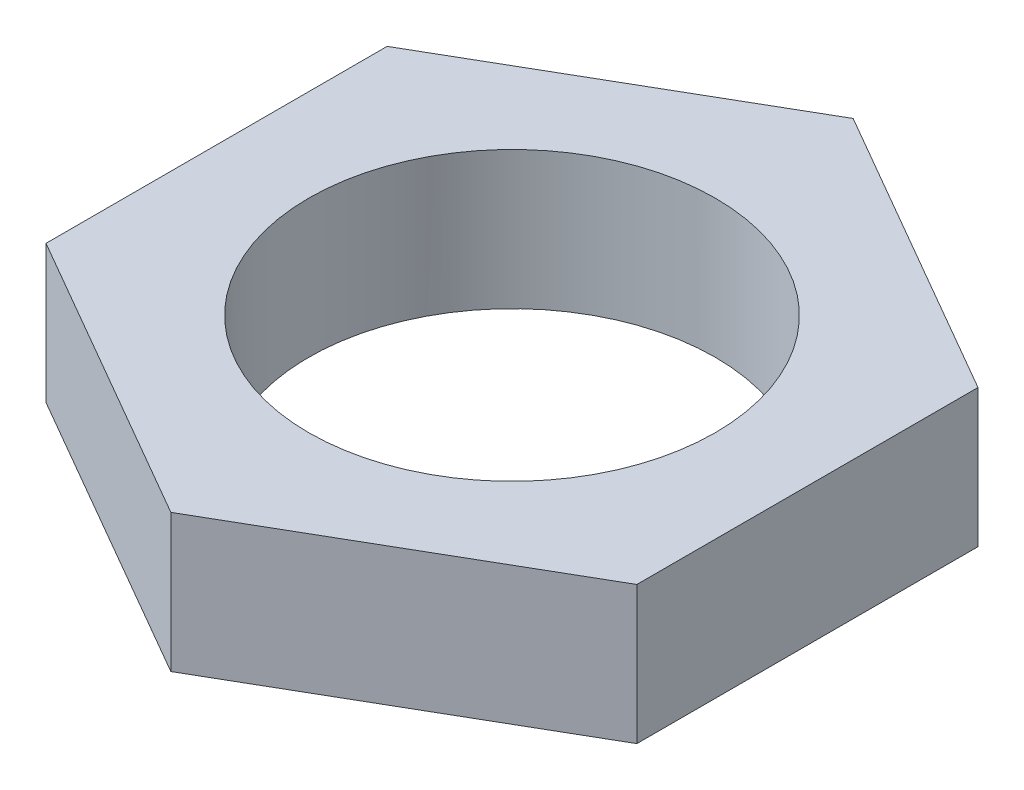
from build123d import *

# Parameters (mm, degrees)
EXTRUDE1_DEPTH              = 7
F_7_8_14_TAPPED_HOLE2_D     = 20.6375
F_7_8_14_TAPPED_HOLE2_DEPTH = 49.89


with BuildPart() as part:
    # Sketch1 → Extrude1 (new body)
    with BuildSketch(Plane(origin=(0, 0, 0), x_dir=(1, 0, 0), z_dir=(0, 1, 0))):
        Polygon((0, 17.320508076), (-15, 8.660254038), (-15, -8.660254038), (0, -17.320508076), (15, -8.660254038), (15, 8.660254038), align=None)
    extrude(amount=EXTRUDE1_DEPTH)

    # 7_8-14 Tapped Hole2
    with Locations(Plane(origin=(0, 0, 0), x_dir=(-1, 0, 0), z_dir=(0, -1, 0))):
        with Locations((0, 0)):
            Hole(F_7_8_14_TAPPED_HOLE2_D / 2, depth=F_7_8_14_TAPPED_HOLE2_DEPTH)


solid = part.part
